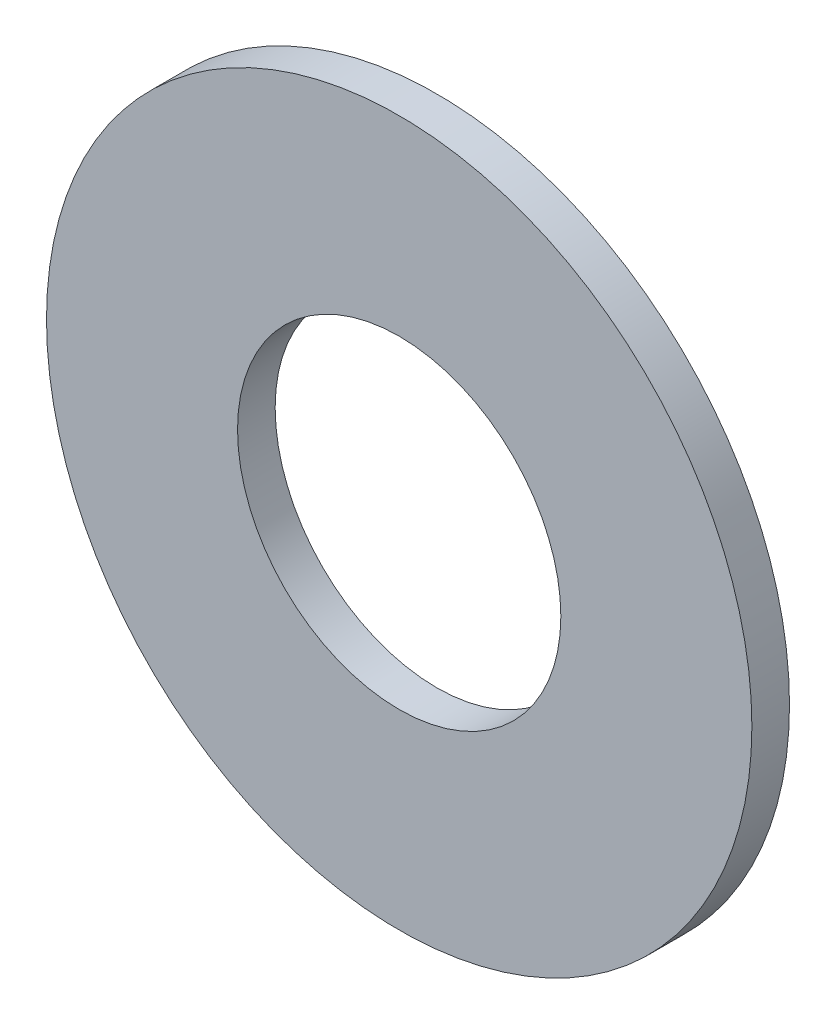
ISO-10303-21;
HEADER;
FILE_DESCRIPTION(('STEP AP214'),'2;1');
FILE_NAME('part.step','',(''),(''),'','','');
FILE_SCHEMA(('AUTOMOTIVE_DESIGN { 1 0 10303 214 1 1 1 1 }'));
ENDSEC;
DATA;
#1=APPLICATION_CONTEXT('core data for automotive mechanical design processes');
#2=APPLICATION_PROTOCOL_DEFINITION('international standard','automotive_design',2000,#1);
#3=PRODUCT_CONTEXT('',#1,'mechanical');
#4=PRODUCT('Part','Part','',(#3));
#5=PRODUCT_RELATED_PRODUCT_CATEGORY('part','',(#4));
#6=PRODUCT_DEFINITION_FORMATION('','',#4);
#7=PRODUCT_DEFINITION_CONTEXT('part definition',#1,'design');
#8=PRODUCT_DEFINITION('design','',#6,#7);
#9=PRODUCT_DEFINITION_SHAPE('','',#8);
#10=(LENGTH_UNIT() NAMED_UNIT(*) SI_UNIT(.MILLI.,.METRE.));
#11=(NAMED_UNIT(*) PLANE_ANGLE_UNIT() SI_UNIT($,.RADIAN.));
#12=(NAMED_UNIT(*) SI_UNIT($,.STERADIAN.) SOLID_ANGLE_UNIT());
#13=UNCERTAINTY_MEASURE_WITH_UNIT(LENGTH_MEASURE(1.E-05),#10,'distance_accuracy_value','');
#14=(GEOMETRIC_REPRESENTATION_CONTEXT(3) GLOBAL_UNCERTAINTY_ASSIGNED_CONTEXT((#13)) GLOBAL_UNIT_ASSIGNED_CONTEXT((#10,
#11,#12)) REPRESENTATION_CONTEXT('',''));
#15=CARTESIAN_POINT('',(0.,0.,0.));
#16=DIRECTION('',(0.,0.,1.));
#17=DIRECTION('',(1.,0.,0.));
#18=AXIS2_PLACEMENT_3D('',#15,#16,#17);
#19=CARTESIAN_POINT('',(0.,0.,-0.508));
#20=DIRECTION('',(0.,0.,1.));
#21=DIRECTION('',(1.,0.,0.));
#22=AXIS2_PLACEMENT_3D('',#19,#20,#21);
#23=CYLINDRICAL_SURFACE('',#22,4.7625);
#24=CARTESIAN_POINT('',(0.,0.,-0.508));
#25=DIRECTION('',(0.,0.,1.));
#26=DIRECTION('',(1.,0.,0.));
#27=AXIS2_PLACEMENT_3D('',#24,#25,#26);
#28=CIRCLE('',#27,4.7625);
#29=CARTESIAN_POINT('',(4.7625,0.,-0.508));
#30=VERTEX_POINT('',#29);
#31=EDGE_CURVE('E10',#30,#30,#28,.T.);
#32=ORIENTED_EDGE('',*,*,#31,.T.);
#33=EDGE_LOOP('',(#32));
#34=FACE_BOUND('',#33,.T.);
#35=CARTESIAN_POINT('',(0.,0.,0.));
#36=DIRECTION('',(0.,0.,1.));
#37=DIRECTION('',(1.,0.,0.));
#38=AXIS2_PLACEMENT_3D('',#35,#36,#37);
#39=CIRCLE('',#38,4.7625);
#40=CARTESIAN_POINT('',(4.7625,0.,0.));
#41=VERTEX_POINT('',#40);
#42=EDGE_CURVE('E39',#41,#41,#39,.T.);
#43=ORIENTED_EDGE('',*,*,#42,.F.);
#44=EDGE_LOOP('',(#43));
#45=FACE_BOUND('',#44,.T.);
#46=ADVANCED_FACE('F36',(#34,#45),#23,.T.);
#47=CARTESIAN_POINT('',(0.,0.,-0.508));
#48=DIRECTION('',(0.,0.,1.));
#49=DIRECTION('',(1.,0.,0.));
#50=AXIS2_PLACEMENT_3D('',#47,#48,#49);
#51=PLANE('',#50);
#52=CARTESIAN_POINT('',(0.,0.,-0.508));
#53=DIRECTION('',(0.,0.,1.));
#54=DIRECTION('',(1.,0.,0.));
#55=AXIS2_PLACEMENT_3D('',#52,#53,#54);
#56=CIRCLE('',#55,2.1828125);
#57=CARTESIAN_POINT('',(2.1828125,0.,-0.508));
#58=VERTEX_POINT('',#57);
#59=EDGE_CURVE('E48',#58,#58,#56,.T.);
#60=ORIENTED_EDGE('',*,*,#59,.T.);
#61=EDGE_LOOP('',(#60));
#62=FACE_BOUND('',#61,.T.);
#63=ORIENTED_EDGE('',*,*,#31,.F.);
#64=EDGE_LOOP('',(#63));
#65=FACE_BOUND('',#64,.T.);
#66=ADVANCED_FACE('F58',(#62,#65),#51,.F.);
#67=CARTESIAN_POINT('',(0.,0.,0.));
#68=DIRECTION('',(0.,0.,1.));
#69=DIRECTION('',(1.,0.,0.));
#70=AXIS2_PLACEMENT_3D('',#67,#68,#69);
#71=PLANE('',#70);
#72=CARTESIAN_POINT('',(0.,0.,0.));
#73=DIRECTION('',(0.,0.,1.));
#74=DIRECTION('',(1.,0.,0.));
#75=AXIS2_PLACEMENT_3D('',#72,#73,#74);
#76=CIRCLE('',#75,2.1828125);
#77=CARTESIAN_POINT('',(2.1828125,0.,0.));
#78=VERTEX_POINT('',#77);
#79=EDGE_CURVE('E50',#78,#78,#76,.T.);
#80=ORIENTED_EDGE('',*,*,#79,.F.);
#81=EDGE_LOOP('',(#80));
#82=FACE_BOUND('',#81,.T.);
#83=ORIENTED_EDGE('',*,*,#42,.T.);
#84=EDGE_LOOP('',(#83));
#85=FACE_BOUND('',#84,.T.);
#86=ADVANCED_FACE('F64',(#82,#85),#71,.T.);
#87=CARTESIAN_POINT('',(0.,0.,-0.508));
#88=DIRECTION('',(0.,0.,1.));
#89=DIRECTION('',(1.,0.,0.));
#90=AXIS2_PLACEMENT_3D('',#87,#88,#89);
#91=CYLINDRICAL_SURFACE('',#90,2.1828125);
#92=ORIENTED_EDGE('',*,*,#59,.F.);
#93=EDGE_LOOP('',(#92));
#94=FACE_BOUND('',#93,.T.);
#95=ORIENTED_EDGE('',*,*,#79,.T.);
#96=EDGE_LOOP('',(#95));
#97=FACE_BOUND('',#96,.T.);
#98=ADVANCED_FACE('F61',(#94,#97),#91,.F.);
#99=CLOSED_SHELL('',(#46,#66,#86,#98));
#100=MANIFOLD_SOLID_BREP('B2',#99);
#101=ADVANCED_BREP_SHAPE_REPRESENTATION('',(#18,#100),#14);
#102=SHAPE_DEFINITION_REPRESENTATION(#9,#101);
ENDSEC;
END-ISO-10303-21;
